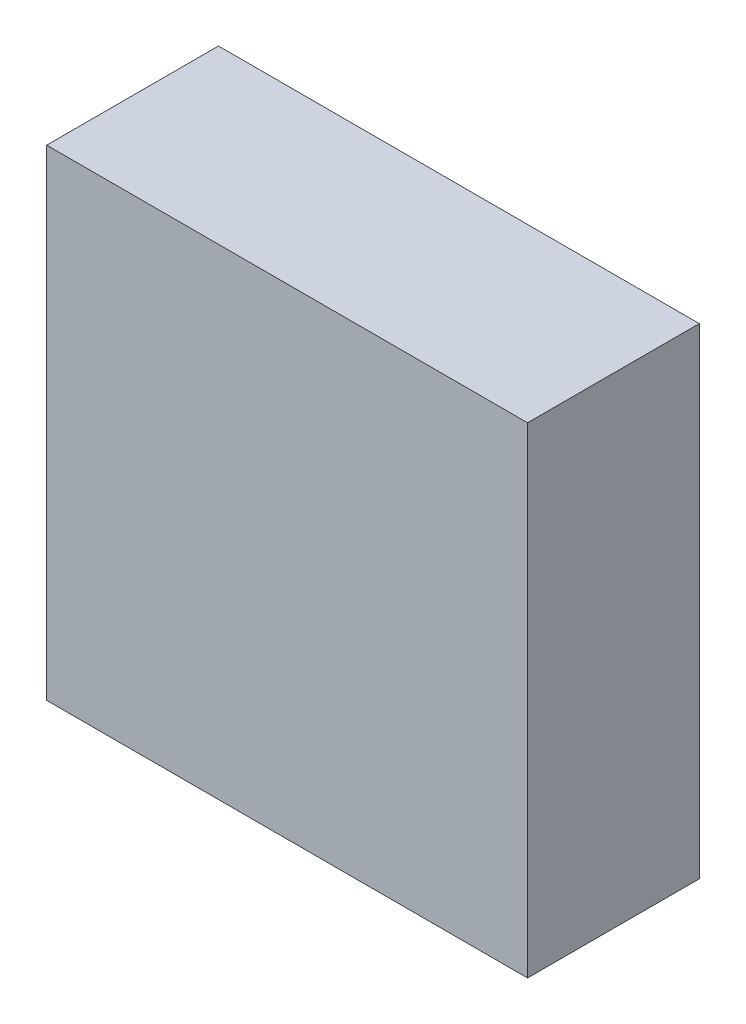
ISO-10303-21;
HEADER;
FILE_DESCRIPTION(('STEP AP214'),'2;1');
FILE_NAME('part.step','',(''),(''),'','','');
FILE_SCHEMA(('AUTOMOTIVE_DESIGN { 1 0 10303 214 1 1 1 1 }'));
ENDSEC;
DATA;
#1=APPLICATION_CONTEXT('core data for automotive mechanical design processes');
#2=APPLICATION_PROTOCOL_DEFINITION('international standard','automotive_design',2000,#1);
#3=PRODUCT_CONTEXT('',#1,'mechanical');
#4=PRODUCT('Part','Part','',(#3));
#5=PRODUCT_RELATED_PRODUCT_CATEGORY('part','',(#4));
#6=PRODUCT_DEFINITION_FORMATION('','',#4);
#7=PRODUCT_DEFINITION_CONTEXT('part definition',#1,'design');
#8=PRODUCT_DEFINITION('design','',#6,#7);
#9=PRODUCT_DEFINITION_SHAPE('','',#8);
#10=(LENGTH_UNIT() NAMED_UNIT(*) SI_UNIT(.MILLI.,.METRE.));
#11=(NAMED_UNIT(*) PLANE_ANGLE_UNIT() SI_UNIT($,.RADIAN.));
#12=(NAMED_UNIT(*) SI_UNIT($,.STERADIAN.) SOLID_ANGLE_UNIT());
#13=UNCERTAINTY_MEASURE_WITH_UNIT(LENGTH_MEASURE(1.E-05),#10,'distance_accuracy_value','');
#14=(GEOMETRIC_REPRESENTATION_CONTEXT(3) GLOBAL_UNCERTAINTY_ASSIGNED_CONTEXT((#13)) GLOBAL_UNIT_ASSIGNED_CONTEXT((#10,
#11,#12)) REPRESENTATION_CONTEXT('',''));
#15=CARTESIAN_POINT('',(0.,0.,0.));
#16=DIRECTION('',(0.,0.,1.));
#17=DIRECTION('',(1.,0.,0.));
#18=AXIS2_PLACEMENT_3D('',#15,#16,#17);
#19=CARTESIAN_POINT('',(-35.,35.,25.));
#20=DIRECTION('',(1.,0.,0.));
#21=DIRECTION('',(0.,1.,0.));
#22=AXIS2_PLACEMENT_3D('',#19,#20,#21);
#23=PLANE('',#22);
#24=DIRECTION('',(0.,-1.,0.));
#25=VECTOR('',#24,1.);
#26=CARTESIAN_POINT('',(-35.,35.,0.));
#27=LINE('',#26,#25);
#28=CARTESIAN_POINT('',(-35.,35.,0.));
#29=VERTEX_POINT('',#28);
#30=CARTESIAN_POINT('',(-35.,-35.,0.));
#31=VERTEX_POINT('',#30);
#32=EDGE_CURVE('E113',#29,#31,#27,.T.);
#33=ORIENTED_EDGE('',*,*,#32,.T.);
#34=DIRECTION('',(0.,0.,-1.));
#35=VECTOR('',#34,1.);
#36=CARTESIAN_POINT('',(-35.,-35.,25.));
#37=LINE('',#36,#35);
#38=CARTESIAN_POINT('',(-35.,-35.,25.));
#39=VERTEX_POINT('',#38);
#40=EDGE_CURVE('E11',#39,#31,#37,.T.);
#41=ORIENTED_EDGE('',*,*,#40,.F.);
#42=DIRECTION('',(0.,-1.,0.));
#43=VECTOR('',#42,1.);
#44=CARTESIAN_POINT('',(-35.,35.,25.));
#45=LINE('',#44,#43);
#46=CARTESIAN_POINT('',(-35.,35.,25.));
#47=VERTEX_POINT('',#46);
#48=EDGE_CURVE('E97',#47,#39,#45,.T.);
#49=ORIENTED_EDGE('',*,*,#48,.F.);
#50=DIRECTION('',(0.,0.,-1.));
#51=VECTOR('',#50,1.);
#52=CARTESIAN_POINT('',(-35.,35.,25.));
#53=LINE('',#52,#51);
#54=EDGE_CURVE('E109',#47,#29,#53,.T.);
#55=ORIENTED_EDGE('',*,*,#54,.T.);
#56=EDGE_LOOP('',(#33,#41,#49,#55));
#57=FACE_BOUND('',#56,.T.);
#58=ADVANCED_FACE('F45',(#57),#23,.F.);
#59=CARTESIAN_POINT('',(-35.,-35.,25.));
#60=DIRECTION('',(0.,1.,0.));
#61=DIRECTION('',(-1.,0.,0.));
#62=AXIS2_PLACEMENT_3D('',#59,#60,#61);
#63=PLANE('',#62);
#64=DIRECTION('',(1.,0.,0.));
#65=VECTOR('',#64,1.);
#66=CARTESIAN_POINT('',(-35.,-35.,0.));
#67=LINE('',#66,#65);
#68=CARTESIAN_POINT('',(35.,-35.,0.));
#69=VERTEX_POINT('',#68);
#70=EDGE_CURVE('E102',#31,#69,#67,.T.);
#71=ORIENTED_EDGE('',*,*,#70,.T.);
#72=DIRECTION('',(0.,0.,-1.));
#73=VECTOR('',#72,1.);
#74=CARTESIAN_POINT('',(35.,-35.,25.));
#75=LINE('',#74,#73);
#76=CARTESIAN_POINT('',(35.,-35.,25.));
#77=VERTEX_POINT('',#76);
#78=EDGE_CURVE('E54',#77,#69,#75,.T.);
#79=ORIENTED_EDGE('',*,*,#78,.F.);
#80=DIRECTION('',(1.,0.,0.));
#81=VECTOR('',#80,1.);
#82=CARTESIAN_POINT('',(-35.,-35.,25.));
#83=LINE('',#82,#81);
#84=EDGE_CURVE('E92',#39,#77,#83,.T.);
#85=ORIENTED_EDGE('',*,*,#84,.F.);
#86=ORIENTED_EDGE('',*,*,#40,.T.);
#87=EDGE_LOOP('',(#71,#79,#85,#86));
#88=FACE_BOUND('',#87,.T.);
#89=ADVANCED_FACE('F101',(#88),#63,.F.);
#90=CARTESIAN_POINT('',(35.,35.,25.));
#91=DIRECTION('',(-1.,0.,0.));
#92=DIRECTION('',(0.,-1.,0.));
#93=AXIS2_PLACEMENT_3D('',#90,#91,#92);
#94=PLANE('',#93);
#95=DIRECTION('',(0.,1.,0.));
#96=VECTOR('',#95,1.);
#97=CARTESIAN_POINT('',(35.,35.,0.));
#98=LINE('',#97,#96);
#99=CARTESIAN_POINT('',(35.,35.,0.));
#100=VERTEX_POINT('',#99);
#101=EDGE_CURVE('E79',#69,#100,#98,.T.);
#102=ORIENTED_EDGE('',*,*,#101,.T.);
#103=DIRECTION('',(0.,0.,-1.));
#104=VECTOR('',#103,1.);
#105=CARTESIAN_POINT('',(35.,35.,25.));
#106=LINE('',#105,#104);
#107=CARTESIAN_POINT('',(35.,35.,25.));
#108=VERTEX_POINT('',#107);
#109=EDGE_CURVE('E104',#108,#100,#106,.T.);
#110=ORIENTED_EDGE('',*,*,#109,.F.);
#111=DIRECTION('',(0.,1.,0.));
#112=VECTOR('',#111,1.);
#113=CARTESIAN_POINT('',(35.,35.,25.));
#114=LINE('',#113,#112);
#115=EDGE_CURVE('E95',#77,#108,#114,.T.);
#116=ORIENTED_EDGE('',*,*,#115,.F.);
#117=ORIENTED_EDGE('',*,*,#78,.T.);
#118=EDGE_LOOP('',(#102,#110,#116,#117));
#119=FACE_BOUND('',#118,.T.);
#120=ADVANCED_FACE('F105',(#119),#94,.F.);
#121=CARTESIAN_POINT('',(-35.,35.,25.));
#122=DIRECTION('',(0.,-1.,0.));
#123=DIRECTION('',(0.,0.,-1.));
#124=AXIS2_PLACEMENT_3D('',#121,#122,#123);
#125=PLANE('',#124);
#126=DIRECTION('',(-1.,0.,0.));
#127=VECTOR('',#126,1.);
#128=CARTESIAN_POINT('',(-35.,35.,0.));
#129=LINE('',#128,#127);
#130=EDGE_CURVE('E85',#100,#29,#129,.T.);
#131=ORIENTED_EDGE('',*,*,#130,.T.);
#132=ORIENTED_EDGE('',*,*,#54,.F.);
#133=DIRECTION('',(-1.,0.,0.));
#134=VECTOR('',#133,1.);
#135=CARTESIAN_POINT('',(-35.,35.,25.));
#136=LINE('',#135,#134);
#137=EDGE_CURVE('E62',#108,#47,#136,.T.);
#138=ORIENTED_EDGE('',*,*,#137,.F.);
#139=ORIENTED_EDGE('',*,*,#109,.T.);
#140=EDGE_LOOP('',(#131,#132,#138,#139));
#141=FACE_BOUND('',#140,.T.);
#142=ADVANCED_FACE('F126',(#141),#125,.F.);
#143=CARTESIAN_POINT('',(0.,0.,25.));
#144=DIRECTION('',(0.,0.,1.));
#145=DIRECTION('',(1.,0.,0.));
#146=AXIS2_PLACEMENT_3D('',#143,#144,#145);
#147=PLANE('',#146);
#148=ORIENTED_EDGE('',*,*,#48,.T.);
#149=ORIENTED_EDGE('',*,*,#84,.T.);
#150=ORIENTED_EDGE('',*,*,#115,.T.);
#151=ORIENTED_EDGE('',*,*,#137,.T.);
#152=EDGE_LOOP('',(#148,#149,#150,#151));
#153=FACE_BOUND('',#152,.T.);
#154=ADVANCED_FACE('F93',(#153),#147,.T.);
#155=CARTESIAN_POINT('',(0.,0.,0.));
#156=DIRECTION('',(0.,0.,1.));
#157=DIRECTION('',(1.,0.,0.));
#158=AXIS2_PLACEMENT_3D('',#155,#156,#157);
#159=PLANE('',#158);
#160=ORIENTED_EDGE('',*,*,#32,.F.);
#161=ORIENTED_EDGE('',*,*,#130,.F.);
#162=ORIENTED_EDGE('',*,*,#101,.F.);
#163=ORIENTED_EDGE('',*,*,#70,.F.);
#164=EDGE_LOOP('',(#160,#161,#162,#163));
#165=FACE_BOUND('',#164,.T.);
#166=ADVANCED_FACE('F129',(#165),#159,.F.);
#167=CLOSED_SHELL('',(#58,#89,#120,#142,#154,#166));
#168=MANIFOLD_SOLID_BREP('B2',#167);
#169=ADVANCED_BREP_SHAPE_REPRESENTATION('',(#18,#168),#14);
#170=SHAPE_DEFINITION_REPRESENTATION(#9,#169);
ENDSEC;
END-ISO-10303-21;
